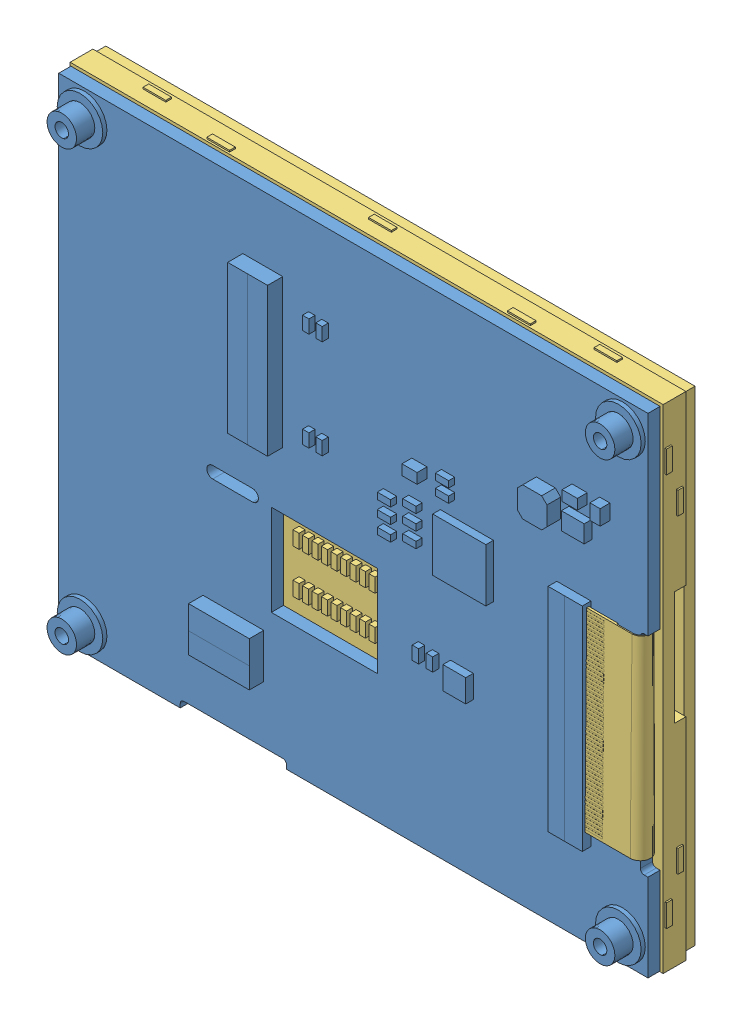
SolidWorks assembly CFAF3202400F-035TS-A1-1.SLDASM, configuration Default (file format 8000). Lengths in mm.
Overall size (78.5 65.92 9.4).
4 component instances, 3 part files, 6 mates.
Components (placement in the parent):
- CFA10086_STEP_Appearance-1: CFA10086_STEP_Appearance.SLDPRT [Default] at origin size (77.6 64.4 4.55)
- VHB Tape-1: VHB Tape.SLDPRT [Default] at (-0.05 22.125 -0.4) size (72.5 12.75 0.4)
- VHB Tape-2: VHB Tape.SLDPRT [Default] at (-0.05 -22.125 -0.4) size (72.5 12.75 0.4)
- CFAF320240F-035TS_STEP_Appearance_Folded_Tail-3: CFAF320240F-035TS_STEP_Appearance_Folded_Tail.SLDPRT [Default] at (-0.25 -0.25 -0.4) x (-1 0 0) z (0 0 -1) size (78.5 65.92 7.24)
Mates (geometry in assembly coordinates):
- Coincident1: coincident anti-aligned: plane of CFA10086_STEP_Appearance-1 through (-22.3 -31.7 0) normal (0 0 -1); plane of VHB Tape-1 through (-0.05 22.125 0) normal (0 0 1)
- Distance2: distance = 3.7 mm aligned: plane of CFA10086_STEP_Appearance-1 through (-38.8 32.2 1.6) normal (0 1 0); plane of VHB Tape-1 through (-36.3 28.5 0) normal (0 1 0)
- Distance4: distance = 2.6 mm: line of VHB Tape-1 through (36.2 15.75 -0.4) axis (0 1 0); plane of CFA10086_STEP_Appearance-1 through (38.8 32.2 1.6) normal (1 0 0)
- Coincident8: coincident anti-aligned: plane of VHB Tape-1 through (-0.05 22.125 -0.4) normal (0 0 -1); plane of CFAF320240F-035TS_STEP_Appearance_Folded_Tail-3 through (-0.25 -0.25 -0.4) normal (0 0 1)
- Coincident9: coincident aligned: plane of CFA10086_STEP_Appearance-1 through (38.8 32.2 1.6) normal (1 0 0); plane of CFAF320240F-035TS_STEP_Appearance_Folded_Tail-3 through (38.8 -0.25 -3.4) normal (1 0 0)
- Coincident10: coincident aligned: plane of CFA10086_STEP_Appearance-1 through (-38.8 32.2 1.6) normal (0 1 0); plane of CFAF320240F-035TS_STEP_Appearance_Folded_Tail-3 through (-0.25 32.2 -3.4) normal (0 1 0)
